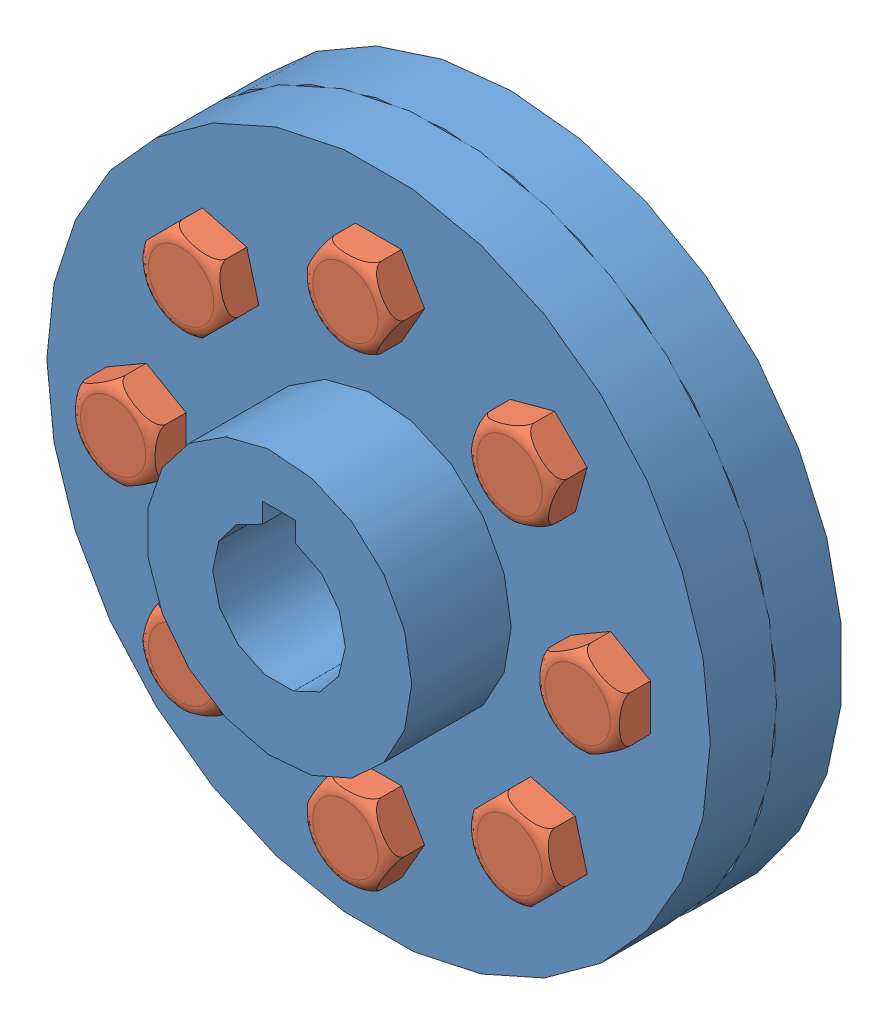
SolidWorks assembly Flange coupling.SLDASM, configuration Default (file format 4400). Lengths in mm.
Overall size (100 100 50).
18 component instances, 3 part files, 7 mates.
Components (placement in the parent):
- Flange-1: Flange.SLDPRT [Default] at origin size (100 100 25)
- Flange-3: Flange.SLDPRT [Default] at (0 0 -50) x (0 -1 0) z (0 0 -1) size (100 100 25)
- Bolt-11: Bolt.SLDPRT [Default] at (17.5888 4.7406 -15) x (-0.502538 0.864555 0) z (0 0 1) size (14.5 12.64 32.03)
- nut-11: nut.SLDPRT [Default] at (34.3678 28.3777 -35) x (0.189207 0.981937 0) z (0 0 -1) size (12.64 14.5 5.07)
- Bolt-12: Bolt.SLDPRT [Default] at (15.7893 -9.0851 -15) x (0.255984 0.966681 0) z (0 0 1) size (14.5 12.64 32.03)
- Bolt-13: Bolt.SLDPRT [Default] at (4.7406 -17.5888 -15) x (0.864555 0.502538 0) z (0 0 1) size (14.5 12.64 32.03)
- Bolt-14: Bolt.SLDPRT [Default] at (-9.0851 -15.7893 -15) x (0.966681 -0.255984 0) z (0 0 1) size (14.5 12.64 32.03)
- Bolt-15: Bolt.SLDPRT [Default] at (-17.5888 -4.7406 -15) x (0.502538 -0.864555 0) z (0 0 1) size (14.5 12.64 32.03)
- Bolt-16: Bolt.SLDPRT [Default] at (-15.7893 9.0851 -15) x (-0.255984 -0.966681 0) z (0 0 1) size (14.5 12.64 32.03)
- nut-12: nut.SLDPRT [Default] at (44.3678 -4.2356 -35) x (0.828124 0.560545 0) z (0 0 -1) size (12.64 14.5 5.07)
- nut-13: nut.SLDPRT [Default] at (28.3777 -34.3678 -35) x (0.981937 -0.189207 0) z (0 0 -1) size (12.64 14.5 5.07)
- nut-14: nut.SLDPRT [Default] at (-4.2356 -44.3678 -35) x (0.560545 -0.828124 0) z (0 0 -1) size (12.64 14.5 5.07)
- nut-15: nut.SLDPRT [Default] at (-34.3678 -28.3777 -35) x (-0.189207 -0.981937 0) z (0 0 -1) size (12.64 14.5 5.07)
- nut-16: nut.SLDPRT [Default] at (-44.3678 4.2356 -35) x (-0.828124 -0.560545 0) z (0 0 -1) size (12.64 14.5 5.07)
- Bolt-17: Bolt.SLDPRT [Default] at (-4.7406 17.5888 -15) x (-0.864555 -0.502538 0) z (0 0 1) size (14.5 12.64 32.03)
- Bolt-18: Bolt.SLDPRT [Default] at (9.0851 15.7893 -15) x (-0.966681 0.255984 0) z (0 0 1) size (14.5 12.64 32.03)
- nut-17: nut.SLDPRT [Default] at (-28.3777 34.3678 -35) x (-0.981937 0.189207 0) z (0 0 -1) size (12.64 14.5 5.07)
- nut-18: nut.SLDPRT [Default] at (4.2356 44.3678 -35) x (-0.560545 0.828124 0) z (0 0 -1) size (12.64 14.5 5.07)
Mates (geometry in assembly coordinates):
- Concentric2: concentric anti-aligned: cylinder of Flange-1 through (0 0 -25) axis (0 0 1) radius 10; cylinder of Flange-3 through (0 0 -50) axis (0 0 -1) radius 50
- Concentric3: concentric anti-aligned: cylinder of Flange-1 through (-24.7487 -24.7487 -25) axis (0 0 1) radius 4; cylinder of Flange-3 through (-24.7487 -24.7487 -25) axis (0 0 -1) radius 4
- Coincident2: coincident anti-aligned: plane of Flange-1 through (0 50 -25) normal (0 0 -1); plane of Flange-3 through (-50 0 -25) normal (0 0 1)
- Concentric4: concentric aligned: cylinder of Flange-1 through (0 35 -25) axis (0 0 1) radius 4; cylinder of Bolt-11 through (0 35 -42) axis (0 0 1) radius 4
- Coincident9: coincident anti-aligned: plane of Flange-1 through (0 20 -15) normal (0 0 1); plane of Bolt-11 through (-3.4817 40.9898 -15) normal (0 0 -1)
- Concentric5: concentric aligned: cylinder of Bolt-11 through (0 35 -42) axis (0 0 1) radius 4; cylinder of nut-11 through (0 35 -40) axis (0 0 1) radius 4
- Coincident10: coincident anti-aligned: plane of Flange-3 through (-20 0 -35) normal (0 0 -1); plane of nut-11 through (6.8031 33.6891 -35) normal (0 0 1)
